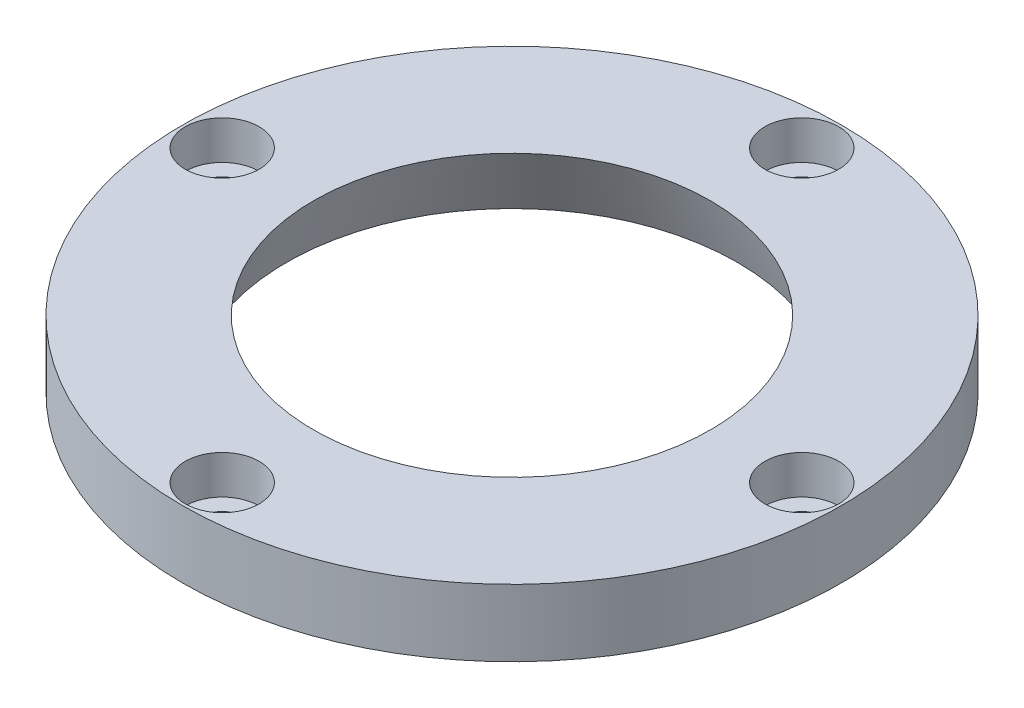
ISO-10303-21;
HEADER;
FILE_DESCRIPTION(('STEP AP214'),'2;1');
FILE_NAME('part.step','',(''),(''),'','','');
FILE_SCHEMA(('AUTOMOTIVE_DESIGN { 1 0 10303 214 1 1 1 1 }'));
ENDSEC;
DATA;
#1=APPLICATION_CONTEXT('core data for automotive mechanical design processes');
#2=APPLICATION_PROTOCOL_DEFINITION('international standard','automotive_design',2000,#1);
#3=PRODUCT_CONTEXT('',#1,'mechanical');
#4=PRODUCT('Part','Part','',(#3));
#5=PRODUCT_RELATED_PRODUCT_CATEGORY('part','',(#4));
#6=PRODUCT_DEFINITION_FORMATION('','',#4);
#7=PRODUCT_DEFINITION_CONTEXT('part definition',#1,'design');
#8=PRODUCT_DEFINITION('design','',#6,#7);
#9=PRODUCT_DEFINITION_SHAPE('','',#8);
#10=(LENGTH_UNIT() NAMED_UNIT(*) SI_UNIT(.MILLI.,.METRE.));
#11=(NAMED_UNIT(*) PLANE_ANGLE_UNIT() SI_UNIT($,.RADIAN.));
#12=(NAMED_UNIT(*) SI_UNIT($,.STERADIAN.) SOLID_ANGLE_UNIT());
#13=UNCERTAINTY_MEASURE_WITH_UNIT(LENGTH_MEASURE(1.E-05),#10,'distance_accuracy_value','');
#14=(GEOMETRIC_REPRESENTATION_CONTEXT(3) GLOBAL_UNCERTAINTY_ASSIGNED_CONTEXT((#13)) GLOBAL_UNIT_ASSIGNED_CONTEXT((#10,
#11,#12)) REPRESENTATION_CONTEXT('',''));
#15=CARTESIAN_POINT('',(0.,0.,0.));
#16=DIRECTION('',(0.,0.,1.));
#17=DIRECTION('',(1.,0.,0.));
#18=AXIS2_PLACEMENT_3D('',#15,#16,#17);
#19=CARTESIAN_POINT('',(0.,0.,0.));
#20=DIRECTION('',(0.,-1.,0.));
#21=DIRECTION('',(0.,0.,-1.));
#22=AXIS2_PLACEMENT_3D('',#19,#20,#21);
#23=CONICAL_SURFACE('',#22,19.85,0.383972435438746);
#24=CARTESIAN_POINT('',(0.,5.9,0.));
#25=DIRECTION('',(0.,-1.,0.));
#26=DIRECTION('',(0.,0.,-1.));
#27=AXIS2_PLACEMENT_3D('',#24,#25,#26);
#28=CIRCLE('',#27,17.4662452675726);
#29=CARTESIAN_POINT('',(0.,5.9,-17.4662452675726));
#30=VERTEX_POINT('',#29);
#31=EDGE_CURVE('E47',#30,#30,#28,.T.);
#32=ORIENTED_EDGE('',*,*,#31,.F.);
#33=EDGE_LOOP('',(#32));
#34=FACE_BOUND('',#33,.T.);
#35=CARTESIAN_POINT('',(0.,0.,0.));
#36=DIRECTION('',(0.,-1.,0.));
#37=DIRECTION('',(0.,0.,-1.));
#38=AXIS2_PLACEMENT_3D('',#35,#36,#37);
#39=CIRCLE('',#38,19.85);
#40=CARTESIAN_POINT('',(0.,0.,-19.85));
#41=VERTEX_POINT('',#40);
#42=EDGE_CURVE('E10',#41,#41,#39,.T.);
#43=ORIENTED_EDGE('',*,*,#42,.T.);
#44=EDGE_LOOP('',(#43));
#45=FACE_BOUND('',#44,.T.);
#46=ADVANCED_FACE('F33',(#34,#45),#23,.F.);
#47=CARTESIAN_POINT('',(-19.85,0.,0.));
#48=DIRECTION('',(0.,1.,0.));
#49=DIRECTION('',(0.,0.,1.));
#50=AXIS2_PLACEMENT_3D('',#47,#48,#49);
#51=PLANE('',#50);
#52=CARTESIAN_POINT('',(25.5,0.,1.73468357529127E-13));
#53=DIRECTION('',(0.,1.,0.));
#54=DIRECTION('',(0.,0.,1.));
#55=AXIS2_PLACEMENT_3D('',#52,#53,#54);
#56=CIRCLE('',#55,1.7);
#57=CARTESIAN_POINT('',(25.5,0.,1.70000000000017));
#58=VERTEX_POINT('',#57);
#59=EDGE_CURVE('E88',#58,#58,#56,.T.);
#60=ORIENTED_EDGE('',*,*,#59,.T.);
#61=EDGE_LOOP('',(#60));
#62=FACE_BOUND('',#61,.T.);
#63=CARTESIAN_POINT('',(1.18408407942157E-13,0.,-25.5));
#64=DIRECTION('',(0.,1.,0.));
#65=DIRECTION('',(0.,0.,1.));
#66=AXIS2_PLACEMENT_3D('',#63,#64,#65);
#67=CIRCLE('',#66,1.7);
#68=CARTESIAN_POINT('',(1.18408407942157E-13,0.,-23.8));
#69=VERTEX_POINT('',#68);
#70=EDGE_CURVE('E76',#69,#69,#67,.T.);
#71=ORIENTED_EDGE('',*,*,#70,.T.);
#72=EDGE_LOOP('',(#71));
#73=FACE_BOUND('',#72,.T.);
#74=CARTESIAN_POINT('',(-25.5,0.,0.));
#75=DIRECTION('',(0.,1.,0.));
#76=DIRECTION('',(0.,0.,1.));
#77=AXIS2_PLACEMENT_3D('',#74,#75,#76);
#78=CIRCLE('',#77,1.7);
#79=CARTESIAN_POINT('',(-25.5,0.,1.69999999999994));
#80=VERTEX_POINT('',#79);
#81=EDGE_CURVE('E64',#80,#80,#78,.T.);
#82=ORIENTED_EDGE('',*,*,#81,.T.);
#83=EDGE_LOOP('',(#82));
#84=FACE_BOUND('',#83,.T.);
#85=CARTESIAN_POINT('',(0.,0.,25.5));
#86=DIRECTION('',(0.,1.,0.));
#87=DIRECTION('',(0.,0.,1.));
#88=AXIS2_PLACEMENT_3D('',#85,#86,#87);
#89=CIRCLE('',#88,1.7);
#90=CARTESIAN_POINT('',(0.,0.,27.2));
#91=VERTEX_POINT('',#90);
#92=EDGE_CURVE('E52',#91,#91,#89,.T.);
#93=ORIENTED_EDGE('',*,*,#92,.T.);
#94=EDGE_LOOP('',(#93));
#95=FACE_BOUND('',#94,.T.);
#96=ORIENTED_EDGE('',*,*,#42,.F.);
#97=EDGE_LOOP('',(#96));
#98=FACE_BOUND('',#97,.T.);
#99=CARTESIAN_POINT('',(0.,0.,0.));
#100=DIRECTION('',(0.,-1.,0.));
#101=DIRECTION('',(0.,0.,-1.));
#102=AXIS2_PLACEMENT_3D('',#99,#100,#101);
#103=CIRCLE('',#102,29.);
#104=CARTESIAN_POINT('',(0.,0.,-29.));
#105=VERTEX_POINT('',#104);
#106=EDGE_CURVE('E39',#105,#105,#103,.T.);
#107=ORIENTED_EDGE('',*,*,#106,.T.);
#108=EDGE_LOOP('',(#107));
#109=FACE_BOUND('',#108,.T.);
#110=ADVANCED_FACE('F120',(#62,#73,#84,#95,#98,#109),#51,.F.);
#111=CARTESIAN_POINT('',(0.,0.,0.));
#112=DIRECTION('',(0.,-1.,0.));
#113=DIRECTION('',(0.,0.,-1.));
#114=AXIS2_PLACEMENT_3D('',#111,#112,#113);
#115=CYLINDRICAL_SURFACE('',#114,29.);
#116=ORIENTED_EDGE('',*,*,#106,.F.);
#117=EDGE_LOOP('',(#116));
#118=FACE_BOUND('',#117,.T.);
#119=CARTESIAN_POINT('',(0.,5.9,0.));
#120=DIRECTION('',(0.,-1.,0.));
#121=DIRECTION('',(0.,0.,-1.));
#122=AXIS2_PLACEMENT_3D('',#119,#120,#121);
#123=CIRCLE('',#122,29.);
#124=CARTESIAN_POINT('',(0.,5.9,-29.));
#125=VERTEX_POINT('',#124);
#126=EDGE_CURVE('E43',#125,#125,#123,.T.);
#127=ORIENTED_EDGE('',*,*,#126,.T.);
#128=EDGE_LOOP('',(#127));
#129=FACE_BOUND('',#128,.T.);
#130=ADVANCED_FACE('F107',(#118,#129),#115,.T.);
#131=CARTESIAN_POINT('',(-29.,5.9,0.));
#132=DIRECTION('',(0.,-1.,0.));
#133=DIRECTION('',(0.,0.,-1.));
#134=AXIS2_PLACEMENT_3D('',#131,#132,#133);
#135=PLANE('',#134);
#136=CARTESIAN_POINT('',(25.5,5.9,1.73468357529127E-13));
#137=DIRECTION('',(0.,1.,0.));
#138=DIRECTION('',(0.,0.,1.));
#139=AXIS2_PLACEMENT_3D('',#136,#137,#138);
#140=CIRCLE('',#139,3.25);
#141=CARTESIAN_POINT('',(25.5,5.9,3.25000000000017));
#142=VERTEX_POINT('',#141);
#143=EDGE_CURVE('E97',#142,#142,#140,.T.);
#144=ORIENTED_EDGE('',*,*,#143,.F.);
#145=EDGE_LOOP('',(#144));
#146=FACE_BOUND('',#145,.T.);
#147=CARTESIAN_POINT('',(1.18408407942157E-13,5.9,-25.5));
#148=DIRECTION('',(0.,1.,0.));
#149=DIRECTION('',(0.,0.,1.));
#150=AXIS2_PLACEMENT_3D('',#147,#148,#149);
#151=CIRCLE('',#150,3.25);
#152=CARTESIAN_POINT('',(1.18408407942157E-13,5.9,-22.25));
#153=VERTEX_POINT('',#152);
#154=EDGE_CURVE('E85',#153,#153,#151,.T.);
#155=ORIENTED_EDGE('',*,*,#154,.F.);
#156=EDGE_LOOP('',(#155));
#157=FACE_BOUND('',#156,.T.);
#158=CARTESIAN_POINT('',(-25.5,5.9,0.));
#159=DIRECTION('',(0.,1.,0.));
#160=DIRECTION('',(0.,0.,1.));
#161=AXIS2_PLACEMENT_3D('',#158,#159,#160);
#162=CIRCLE('',#161,3.25);
#163=CARTESIAN_POINT('',(-25.5,5.9,3.24999999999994));
#164=VERTEX_POINT('',#163);
#165=EDGE_CURVE('E73',#164,#164,#162,.T.);
#166=ORIENTED_EDGE('',*,*,#165,.F.);
#167=EDGE_LOOP('',(#166));
#168=FACE_BOUND('',#167,.T.);
#169=CARTESIAN_POINT('',(0.,5.9,25.5));
#170=DIRECTION('',(0.,1.,0.));
#171=DIRECTION('',(0.,0.,1.));
#172=AXIS2_PLACEMENT_3D('',#169,#170,#171);
#173=CIRCLE('',#172,3.25);
#174=CARTESIAN_POINT('',(0.,5.9,28.75));
#175=VERTEX_POINT('',#174);
#176=EDGE_CURVE('E61',#175,#175,#173,.T.);
#177=ORIENTED_EDGE('',*,*,#176,.F.);
#178=EDGE_LOOP('',(#177));
#179=FACE_BOUND('',#178,.T.);
#180=ORIENTED_EDGE('',*,*,#126,.F.);
#181=EDGE_LOOP('',(#180));
#182=FACE_BOUND('',#181,.T.);
#183=ORIENTED_EDGE('',*,*,#31,.T.);
#184=EDGE_LOOP('',(#183));
#185=FACE_BOUND('',#184,.T.);
#186=ADVANCED_FACE('F103',(#146,#157,#168,#179,#182,#185),#135,.F.);
#187=CARTESIAN_POINT('',(0.,5.9,25.5));
#188=DIRECTION('',(0.,1.,0.));
#189=DIRECTION('',(0.,0.,1.));
#190=AXIS2_PLACEMENT_3D('',#187,#188,#189);
#191=CYLINDRICAL_SURFACE('',#190,1.7);
#192=ORIENTED_EDGE('',*,*,#92,.F.);
#193=EDGE_LOOP('',(#192));
#194=FACE_BOUND('',#193,.T.);
#195=CARTESIAN_POINT('',(0.,2.5,25.5));
#196=DIRECTION('',(0.,1.,0.));
#197=DIRECTION('',(0.,0.,1.));
#198=AXIS2_PLACEMENT_3D('',#195,#196,#197);
#199=CIRCLE('',#198,1.7);
#200=CARTESIAN_POINT('',(0.,2.5,27.2));
#201=VERTEX_POINT('',#200);
#202=EDGE_CURVE('E55',#201,#201,#199,.T.);
#203=ORIENTED_EDGE('',*,*,#202,.T.);
#204=EDGE_LOOP('',(#203));
#205=FACE_BOUND('',#204,.T.);
#206=ADVANCED_FACE('F106',(#194,#205),#191,.F.);
#207=CARTESIAN_POINT('',(1.7,2.5,25.5));
#208=DIRECTION('',(0.,-1.,0.));
#209=DIRECTION('',(0.,0.,-1.));
#210=AXIS2_PLACEMENT_3D('',#207,#208,#209);
#211=PLANE('',#210);
#212=ORIENTED_EDGE('',*,*,#202,.F.);
#213=EDGE_LOOP('',(#212));
#214=FACE_BOUND('',#213,.T.);
#215=CARTESIAN_POINT('',(0.,2.5,25.5));
#216=DIRECTION('',(0.,1.,0.));
#217=DIRECTION('',(0.,0.,1.));
#218=AXIS2_PLACEMENT_3D('',#215,#216,#217);
#219=CIRCLE('',#218,3.25);
#220=CARTESIAN_POINT('',(0.,2.5,28.75));
#221=VERTEX_POINT('',#220);
#222=EDGE_CURVE('E58',#221,#221,#219,.T.);
#223=ORIENTED_EDGE('',*,*,#222,.T.);
#224=EDGE_LOOP('',(#223));
#225=FACE_BOUND('',#224,.T.);
#226=ADVANCED_FACE('F134',(#214,#225),#211,.F.);
#227=CARTESIAN_POINT('',(0.,5.9,25.5));
#228=DIRECTION('',(0.,1.,0.));
#229=DIRECTION('',(0.,0.,1.));
#230=AXIS2_PLACEMENT_3D('',#227,#228,#229);
#231=CYLINDRICAL_SURFACE('',#230,3.25);
#232=ORIENTED_EDGE('',*,*,#222,.F.);
#233=EDGE_LOOP('',(#232));
#234=FACE_BOUND('',#233,.T.);
#235=ORIENTED_EDGE('',*,*,#176,.T.);
#236=EDGE_LOOP('',(#235));
#237=FACE_BOUND('',#236,.T.);
#238=ADVANCED_FACE('F138',(#234,#237),#231,.F.);
#239=CARTESIAN_POINT('',(-25.5,5.9,0.));
#240=DIRECTION('',(0.,1.,0.));
#241=DIRECTION('',(0.,0.,1.));
#242=AXIS2_PLACEMENT_3D('',#239,#240,#241);
#243=CYLINDRICAL_SURFACE('',#242,1.7);
#244=ORIENTED_EDGE('',*,*,#81,.F.);
#245=EDGE_LOOP('',(#244));
#246=FACE_BOUND('',#245,.T.);
#247=CARTESIAN_POINT('',(-25.5,2.5,0.));
#248=DIRECTION('',(0.,1.,0.));
#249=DIRECTION('',(0.,0.,1.));
#250=AXIS2_PLACEMENT_3D('',#247,#248,#249);
#251=CIRCLE('',#250,1.7);
#252=CARTESIAN_POINT('',(-25.5,2.5,1.69999999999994));
#253=VERTEX_POINT('',#252);
#254=EDGE_CURVE('E67',#253,#253,#251,.T.);
#255=ORIENTED_EDGE('',*,*,#254,.T.);
#256=EDGE_LOOP('',(#255));
#257=FACE_BOUND('',#256,.T.);
#258=ADVANCED_FACE('F142',(#246,#257),#243,.F.);
#259=CARTESIAN_POINT('',(-23.8,2.5,0.));
#260=DIRECTION('',(0.,-1.,0.));
#261=DIRECTION('',(0.,0.,-1.));
#262=AXIS2_PLACEMENT_3D('',#259,#260,#261);
#263=PLANE('',#262);
#264=ORIENTED_EDGE('',*,*,#254,.F.);
#265=EDGE_LOOP('',(#264));
#266=FACE_BOUND('',#265,.T.);
#267=CARTESIAN_POINT('',(-25.5,2.5,0.));
#268=DIRECTION('',(0.,1.,0.));
#269=DIRECTION('',(0.,0.,1.));
#270=AXIS2_PLACEMENT_3D('',#267,#268,#269);
#271=CIRCLE('',#270,3.25);
#272=CARTESIAN_POINT('',(-25.5,2.5,3.24999999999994));
#273=VERTEX_POINT('',#272);
#274=EDGE_CURVE('E70',#273,#273,#271,.T.);
#275=ORIENTED_EDGE('',*,*,#274,.T.);
#276=EDGE_LOOP('',(#275));
#277=FACE_BOUND('',#276,.T.);
#278=ADVANCED_FACE('F146',(#266,#277),#263,.F.);
#279=CARTESIAN_POINT('',(-25.5,5.9,0.));
#280=DIRECTION('',(0.,1.,0.));
#281=DIRECTION('',(0.,0.,1.));
#282=AXIS2_PLACEMENT_3D('',#279,#280,#281);
#283=CYLINDRICAL_SURFACE('',#282,3.25);
#284=ORIENTED_EDGE('',*,*,#274,.F.);
#285=EDGE_LOOP('',(#284));
#286=FACE_BOUND('',#285,.T.);
#287=ORIENTED_EDGE('',*,*,#165,.T.);
#288=EDGE_LOOP('',(#287));
#289=FACE_BOUND('',#288,.T.);
#290=ADVANCED_FACE('F150',(#286,#289),#283,.F.);
#291=CARTESIAN_POINT('',(1.18408407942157E-13,5.9,-25.5));
#292=DIRECTION('',(0.,1.,0.));
#293=DIRECTION('',(0.,0.,1.));
#294=AXIS2_PLACEMENT_3D('',#291,#292,#293);
#295=CYLINDRICAL_SURFACE('',#294,1.7);
#296=ORIENTED_EDGE('',*,*,#70,.F.);
#297=EDGE_LOOP('',(#296));
#298=FACE_BOUND('',#297,.T.);
#299=CARTESIAN_POINT('',(1.18408407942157E-13,2.5,-25.5));
#300=DIRECTION('',(0.,1.,0.));
#301=DIRECTION('',(0.,0.,1.));
#302=AXIS2_PLACEMENT_3D('',#299,#300,#301);
#303=CIRCLE('',#302,1.7);
#304=CARTESIAN_POINT('',(1.18408407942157E-13,2.5,-23.8));
#305=VERTEX_POINT('',#304);
#306=EDGE_CURVE('E79',#305,#305,#303,.T.);
#307=ORIENTED_EDGE('',*,*,#306,.T.);
#308=EDGE_LOOP('',(#307));
#309=FACE_BOUND('',#308,.T.);
#310=ADVANCED_FACE('F154',(#298,#309),#295,.F.);
#311=CARTESIAN_POINT('',(1.70000000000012,2.5,-25.5));
#312=DIRECTION('',(0.,-1.,0.));
#313=DIRECTION('',(0.,0.,-1.));
#314=AXIS2_PLACEMENT_3D('',#311,#312,#313);
#315=PLANE('',#314);
#316=ORIENTED_EDGE('',*,*,#306,.F.);
#317=EDGE_LOOP('',(#316));
#318=FACE_BOUND('',#317,.T.);
#319=CARTESIAN_POINT('',(1.18408407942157E-13,2.5,-25.5));
#320=DIRECTION('',(0.,1.,0.));
#321=DIRECTION('',(0.,0.,1.));
#322=AXIS2_PLACEMENT_3D('',#319,#320,#321);
#323=CIRCLE('',#322,3.25);
#324=CARTESIAN_POINT('',(1.18408407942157E-13,2.5,-22.25));
#325=VERTEX_POINT('',#324);
#326=EDGE_CURVE('E82',#325,#325,#323,.T.);
#327=ORIENTED_EDGE('',*,*,#326,.T.);
#328=EDGE_LOOP('',(#327));
#329=FACE_BOUND('',#328,.T.);
#330=ADVANCED_FACE('F158',(#318,#329),#315,.F.);
#331=CARTESIAN_POINT('',(1.18408407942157E-13,5.9,-25.5));
#332=DIRECTION('',(0.,1.,0.));
#333=DIRECTION('',(0.,0.,1.));
#334=AXIS2_PLACEMENT_3D('',#331,#332,#333);
#335=CYLINDRICAL_SURFACE('',#334,3.25);
#336=ORIENTED_EDGE('',*,*,#326,.F.);
#337=EDGE_LOOP('',(#336));
#338=FACE_BOUND('',#337,.T.);
#339=ORIENTED_EDGE('',*,*,#154,.T.);
#340=EDGE_LOOP('',(#339));
#341=FACE_BOUND('',#340,.T.);
#342=ADVANCED_FACE('F162',(#338,#341),#335,.F.);
#343=CARTESIAN_POINT('',(25.5,5.9,1.73468357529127E-13));
#344=DIRECTION('',(0.,1.,0.));
#345=DIRECTION('',(0.,0.,1.));
#346=AXIS2_PLACEMENT_3D('',#343,#344,#345);
#347=CYLINDRICAL_SURFACE('',#346,1.7);
#348=ORIENTED_EDGE('',*,*,#59,.F.);
#349=EDGE_LOOP('',(#348));
#350=FACE_BOUND('',#349,.T.);
#351=CARTESIAN_POINT('',(25.5,2.5,1.73468357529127E-13));
#352=DIRECTION('',(0.,1.,0.));
#353=DIRECTION('',(0.,0.,1.));
#354=AXIS2_PLACEMENT_3D('',#351,#352,#353);
#355=CIRCLE('',#354,1.7);
#356=CARTESIAN_POINT('',(25.5,2.5,1.70000000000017));
#357=VERTEX_POINT('',#356);
#358=EDGE_CURVE('E91',#357,#357,#355,.T.);
#359=ORIENTED_EDGE('',*,*,#358,.T.);
#360=EDGE_LOOP('',(#359));
#361=FACE_BOUND('',#360,.T.);
#362=ADVANCED_FACE('F166',(#350,#361),#347,.F.);
#363=CARTESIAN_POINT('',(27.2,2.5,1.73468357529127E-13));
#364=DIRECTION('',(0.,-1.,0.));
#365=DIRECTION('',(0.,0.,-1.));
#366=AXIS2_PLACEMENT_3D('',#363,#364,#365);
#367=PLANE('',#366);
#368=ORIENTED_EDGE('',*,*,#358,.F.);
#369=EDGE_LOOP('',(#368));
#370=FACE_BOUND('',#369,.T.);
#371=CARTESIAN_POINT('',(25.5,2.5,1.73468357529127E-13));
#372=DIRECTION('',(0.,1.,0.));
#373=DIRECTION('',(0.,0.,1.));
#374=AXIS2_PLACEMENT_3D('',#371,#372,#373);
#375=CIRCLE('',#374,3.25);
#376=CARTESIAN_POINT('',(25.5,2.5,3.25000000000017));
#377=VERTEX_POINT('',#376);
#378=EDGE_CURVE('E94',#377,#377,#375,.T.);
#379=ORIENTED_EDGE('',*,*,#378,.T.);
#380=EDGE_LOOP('',(#379));
#381=FACE_BOUND('',#380,.T.);
#382=ADVANCED_FACE('F170',(#370,#381),#367,.F.);
#383=CARTESIAN_POINT('',(25.5,5.9,1.73468357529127E-13));
#384=DIRECTION('',(0.,1.,0.));
#385=DIRECTION('',(0.,0.,1.));
#386=AXIS2_PLACEMENT_3D('',#383,#384,#385);
#387=CYLINDRICAL_SURFACE('',#386,3.25);
#388=ORIENTED_EDGE('',*,*,#378,.F.);
#389=EDGE_LOOP('',(#388));
#390=FACE_BOUND('',#389,.T.);
#391=ORIENTED_EDGE('',*,*,#143,.T.);
#392=EDGE_LOOP('',(#391));
#393=FACE_BOUND('',#392,.T.);
#394=ADVANCED_FACE('F101',(#390,#393),#387,.F.);
#395=CLOSED_SHELL('',(#46,#110,#130,#186,#206,#226,#238,#258,#278,#290,#310,#330,#342,#362,#382,#394));
#396=MANIFOLD_SOLID_BREP('B2',#395);
#397=ADVANCED_BREP_SHAPE_REPRESENTATION('',(#18,#396),#14);
#398=SHAPE_DEFINITION_REPRESENTATION(#9,#397);
ENDSEC;
END-ISO-10303-21;
